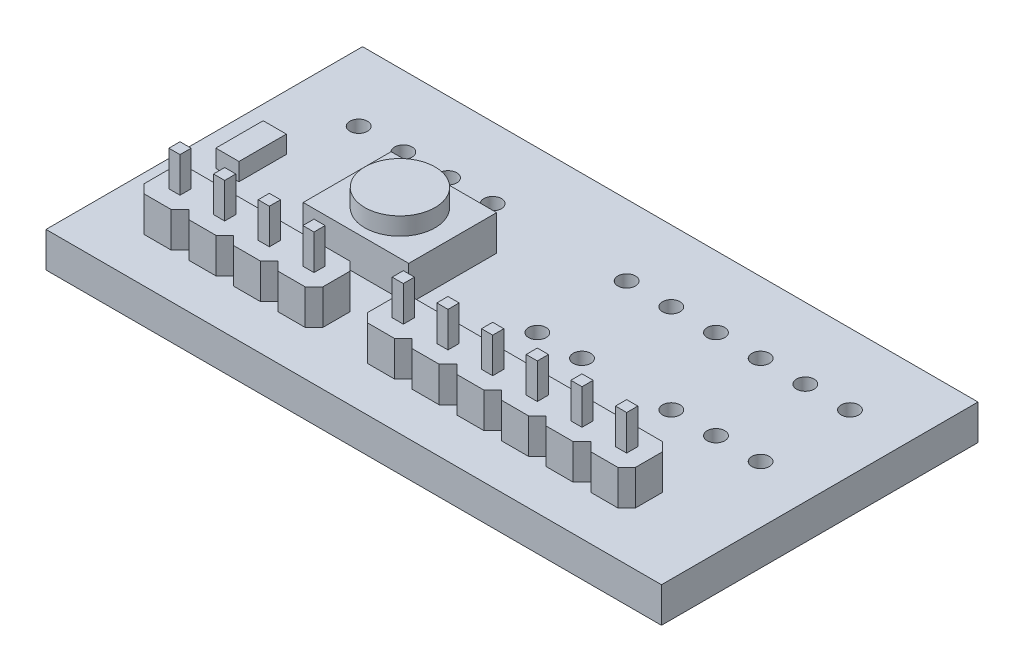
from build123d import *

# Parameters (mm, degrees)
SKETCH1_W          = 35
SKETCH1_H          = 18
SKETCH1_R          = 0.5
BOARD_DEPTH        = 2
SKETCH2_W          = 6
SKETCH2_H          = 5
BUTTON_BASE_DEPTH  = 2
SKETCH3_W          = 1.317928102
SKETCH3_H          = 2.694561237
RESISTOR_DEPTH     = 1
SKETCH4_R          = 2
BUTTON_DEPTH       = 1
HEADER_BLOCK_DEPTH = 2
PIN_START          = -7
SKETCH6_W          = 0.635
SKETCH6_H          = 0.635
PIN_DEPTH          = 9
LPATTERN1_COUNT    = 11
LPATTERN1_PITCH    = 2.54


with BuildPart() as part:
    # Sketch1 → Board (new body)
    with BuildSketch(Plane(origin=(0, 0, 0), x_dir=(1, 0, 0), z_dir=(0, 1, 0))):
        with Locations((17.5, 9)):
            Rectangle(SKETCH1_W, SKETCH1_H)
        with Locations(Location((3.81, 3.81, 0), (0, 0, 270))):
            Circle(SKETCH1_R, mode=Mode.SUBTRACT)
        with Locations(Location((6.35, 3.81, 0), (0, 0, 270))):
            Circle(SKETCH1_R, mode=Mode.SUBTRACT)
        with Locations(Location((8.89, 3.81, 0), (0, 0, 270))):
            Circle(SKETCH1_R, mode=Mode.SUBTRACT)
        with Locations(Location((11.43, 3.81, 0), (0, 0, 270))):
            Circle(SKETCH1_R, mode=Mode.SUBTRACT)
        with Locations(Location((16.51, 3.81, 0), (0, 0, 270))):
            Circle(SKETCH1_R, mode=Mode.SUBTRACT)
        with Locations(Location((19.05, 3.81, 0), (0, 0, 270))):
            Circle(SKETCH1_R, mode=Mode.SUBTRACT)
        with Locations(Location((21.59, 3.81, 0), (0, 0, 270))):
            Circle(SKETCH1_R, mode=Mode.SUBTRACT)
        with Locations(Location((24.13, 3.81, 0), (0, 0, 270))):
            Circle(SKETCH1_R, mode=Mode.SUBTRACT)
        with Locations(Location((26.67, 3.81, 0), (0, 0, 270))):
            Circle(SKETCH1_R, mode=Mode.SUBTRACT)
        with Locations(Location((29.21, 3.81, 0), (0, 0, 270))):
            Circle(SKETCH1_R, mode=Mode.SUBTRACT)
        with Locations(Location((19.05, 8.89, 0), (0, 0, 270))):
            Circle(SKETCH1_R, mode=Mode.SUBTRACT)
        with Locations(Location((21.59, 8.89, 0), (0, 0, 270))):
            Circle(SKETCH1_R, mode=Mode.SUBTRACT)
        with Locations(Location((26.67, 8.89, 0), (0, 0, 270))):
            Circle(SKETCH1_R, mode=Mode.SUBTRACT)
        with Locations(Location((29.21, 8.89, 0), (0, 0, 270))):
            Circle(SKETCH1_R, mode=Mode.SUBTRACT)
        with Locations(Location((31.75, 8.89, 0), (0, 0, 270))):
            Circle(SKETCH1_R, mode=Mode.SUBTRACT)
        with Locations(Location((6.35, 13.97, 0), (0, 0, 270))):
            Circle(SKETCH1_R, mode=Mode.SUBTRACT)
        with Locations(Location((8.89, 13.97, 0), (0, 0, 270))):
            Circle(SKETCH1_R, mode=Mode.SUBTRACT)
        with Locations(Location((11.43, 13.97, 0), (0, 0, 270))):
            Circle(SKETCH1_R, mode=Mode.SUBTRACT)
        with Locations(Location((19.05, 13.97, 0), (0, 0, 270))):
            Circle(SKETCH1_R, mode=Mode.SUBTRACT)
        with Locations(Location((21.59, 13.97, 0), (0, 0, 270))):
            Circle(SKETCH1_R, mode=Mode.SUBTRACT)
        with Locations(Location((24.13, 13.97, 0), (0, 0, 270))):
            Circle(SKETCH1_R, mode=Mode.SUBTRACT)
        with Locations(Location((26.67, 13.97, 0), (0, 0, 270))):
            Circle(SKETCH1_R, mode=Mode.SUBTRACT)
        with Locations(Location((29.21, 13.97, 0), (0, 0, 270))):
            Circle(SKETCH1_R, mode=Mode.SUBTRACT)
        with Locations(Location((31.75, 13.97, 0), (0, 0, 270))):
            Circle(SKETCH1_R, mode=Mode.SUBTRACT)
        with Locations(Location((3.81, 13.97, 0), (0, 0, 270))):
            Circle(SKETCH1_R, mode=Mode.SUBTRACT)
    extrude(amount=BOARD_DEPTH)

    # Sketch2 → Button base (add)
    with BuildSketch(Plane(origin=(0, 2, 0), x_dir=(1, 0, 0), z_dir=(0, 1, 0))):
        with Locations((10.986223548, 9.140075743)):
            Rectangle(SKETCH2_W, SKETCH2_H)
    extrude(amount=BUTTON_BASE_DEPTH)

    # Sketch3 → Resistor (add)
    with BuildSketch(Plane(origin=(0, 2, 0), x_dir=(1, 0, 0), z_dir=(0, 1, 0))):
        with Locations((2.481932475, 9.180026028)):
            Rectangle(SKETCH3_W, SKETCH3_H)
    extrude(amount=RESISTOR_DEPTH)

    # Sketch4 → Button (add)
    with BuildSketch(Plane(origin=(0, 4, 0), x_dir=(1, 0, 0), z_dir=(0, 1, 0))):
        with Locations(Location((10.986223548, 9.140075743, 0), (0, 0, 270))):
            Circle(SKETCH4_R)
    extrude(amount=BUTTON_DEPTH)

    # Sketch5 → Header block (add)
    with BuildSketch(Plane(origin=(0, 2, 0), x_dir=(1, 0, 0), z_dir=(0, 1, 0))):
        Polygon((3.04, 5.08), (4.58, 5.08), (5.08, 4.58), (5.08, 3.04), (4.58, 2.54), (3.04, 2.54), (2.54, 3.04), (2.54, 4.58), align=None)
    header_block = extrude(amount=HEADER_BLOCK_DEPTH)

    # Sketch6 → Pin (add)
    with BuildSketch(Plane(origin=(0, 4, 0), x_dir=(1, 0, 0), z_dir=(0, 1, 0)).offset(PIN_START)):
        with Locations((3.81, 3.81)):
            Rectangle(SKETCH6_W, SKETCH6_H)
    pin = extrude(amount=PIN_DEPTH)

    # LPattern1: Header block, Pin ×11, 1 skipped
    with Locations(*[(i * LPATTERN1_PITCH, 0, 0) for i in range(1, LPATTERN1_COUNT) if i not in (4,)]):
        add(header_block)
        add(pin)


solid = part.part
